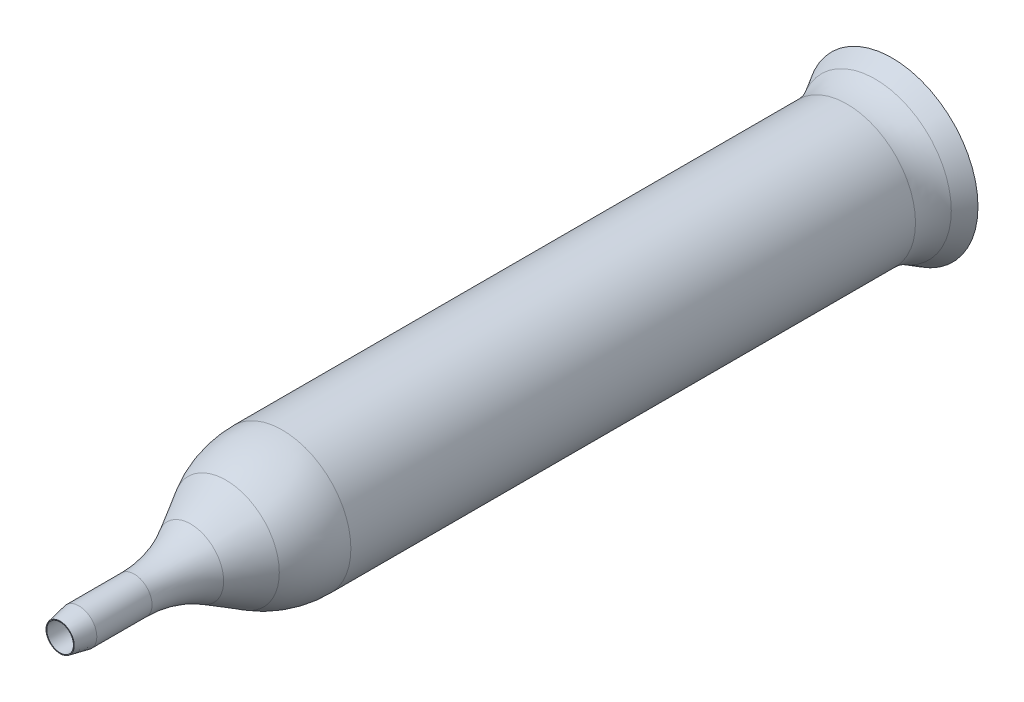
ISO-10303-21;
HEADER;
FILE_DESCRIPTION(('STEP AP214'),'2;1');
FILE_NAME('part.step','',(''),(''),'','','');
FILE_SCHEMA(('AUTOMOTIVE_DESIGN { 1 0 10303 214 1 1 1 1 }'));
ENDSEC;
DATA;
#1=APPLICATION_CONTEXT('core data for automotive mechanical design processes');
#2=APPLICATION_PROTOCOL_DEFINITION('international standard','automotive_design',2000,#1);
#3=PRODUCT_CONTEXT('',#1,'mechanical');
#4=PRODUCT('Part','Part','',(#3));
#5=PRODUCT_RELATED_PRODUCT_CATEGORY('part','',(#4));
#6=PRODUCT_DEFINITION_FORMATION('','',#4);
#7=PRODUCT_DEFINITION_CONTEXT('part definition',#1,'design');
#8=PRODUCT_DEFINITION('design','',#6,#7);
#9=PRODUCT_DEFINITION_SHAPE('','',#8);
#10=(LENGTH_UNIT() NAMED_UNIT(*) SI_UNIT(.MILLI.,.METRE.));
#11=(NAMED_UNIT(*) PLANE_ANGLE_UNIT() SI_UNIT($,.RADIAN.));
#12=(NAMED_UNIT(*) SI_UNIT($,.STERADIAN.) SOLID_ANGLE_UNIT());
#13=UNCERTAINTY_MEASURE_WITH_UNIT(LENGTH_MEASURE(1.E-05),#10,'distance_accuracy_value','');
#14=(GEOMETRIC_REPRESENTATION_CONTEXT(3) GLOBAL_UNCERTAINTY_ASSIGNED_CONTEXT((#13)) GLOBAL_UNIT_ASSIGNED_CONTEXT((#10,
#11,#12)) REPRESENTATION_CONTEXT('',''));
#15=CARTESIAN_POINT('',(0.,0.,0.));
#16=DIRECTION('',(0.,0.,1.));
#17=DIRECTION('',(1.,0.,0.));
#18=AXIS2_PLACEMENT_3D('',#15,#16,#17);
#19=CARTESIAN_POINT('',(0.,3.55,133.805898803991));
#20=DIRECTION('',(0.,0.,-1.));
#21=DIRECTION('',(-1.,0.,0.));
#22=AXIS2_PLACEMENT_3D('',#19,#20,#21);
#23=PLANE('',#22);
#24=CARTESIAN_POINT('',(0.,0.,133.805898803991));
#25=DIRECTION('',(0.,0.,-1.));
#26=DIRECTION('',(-1.,0.,0.));
#27=AXIS2_PLACEMENT_3D('',#24,#25,#26);
#28=CIRCLE('',#27,3.75000000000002);
#29=CARTESIAN_POINT('',(-3.75000000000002,0.,133.805898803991));
#30=VERTEX_POINT('',#29);
#31=EDGE_CURVE('E45',#30,#30,#28,.F.);
#32=ORIENTED_EDGE('',*,*,#31,.T.);
#33=EDGE_LOOP('',(#32));
#34=FACE_BOUND('',#33,.T.);
#35=CARTESIAN_POINT('',(0.,0.,133.805898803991));
#36=DIRECTION('',(0.,0.,1.));
#37=DIRECTION('',(1.,0.,0.));
#38=AXIS2_PLACEMENT_3D('',#35,#36,#37);
#39=CIRCLE('',#38,3.55);
#40=CARTESIAN_POINT('',(3.55,0.,133.805898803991));
#41=VERTEX_POINT('',#40);
#42=EDGE_CURVE('E94',#41,#41,#39,.T.);
#43=ORIENTED_EDGE('',*,*,#42,.F.);
#44=EDGE_LOOP('',(#43));
#45=FACE_BOUND('',#44,.T.);
#46=ADVANCED_FACE('F37',(#34,#45),#23,.F.);
#47=CARTESIAN_POINT('',(0.,0.,0.));
#48=DIRECTION('',(0.,0.,1.));
#49=DIRECTION('',(1.,0.,0.));
#50=AXIS2_PLACEMENT_3D('',#47,#48,#49);
#51=CYLINDRICAL_SURFACE('',#50,4.75);
#52=CARTESIAN_POINT('',(0.,0.,128.805898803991));
#53=DIRECTION('',(0.,0.,-1.));
#54=DIRECTION('',(-1.,0.,0.));
#55=AXIS2_PLACEMENT_3D('',#52,#53,#54);
#56=CIRCLE('',#55,4.75);
#57=CARTESIAN_POINT('',(-4.75,0.,128.805898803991));
#58=VERTEX_POINT('',#57);
#59=EDGE_CURVE('E10',#58,#58,#56,.T.);
#60=ORIENTED_EDGE('',*,*,#59,.T.);
#61=EDGE_LOOP('',(#60));
#62=FACE_BOUND('',#61,.T.);
#63=CARTESIAN_POINT('',(0.,0.,114.127437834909));
#64=DIRECTION('',(0.,0.,1.));
#65=DIRECTION('',(1.,0.,0.));
#66=AXIS2_PLACEMENT_3D('',#63,#64,#65);
#67=CIRCLE('',#66,4.75);
#68=CARTESIAN_POINT('',(4.75,0.,114.127437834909));
#69=VERTEX_POINT('',#68);
#70=EDGE_CURVE('E49',#69,#69,#67,.T.);
#71=ORIENTED_EDGE('',*,*,#70,.T.);
#72=EDGE_LOOP('',(#71));
#73=FACE_BOUND('',#72,.T.);
#74=ADVANCED_FACE('F101',(#62,#73),#51,.T.);
#75=CARTESIAN_POINT('',(0.,0.,114.127437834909));
#76=DIRECTION('',(0.,0.,1.));
#77=DIRECTION('',(1.,0.,0.));
#78=AXIS2_PLACEMENT_3D('',#75,#76,#77);
#79=TOROIDAL_SURFACE('',#78,34.75,30.);
#80=ORIENTED_EDGE('',*,*,#70,.F.);
#81=EDGE_LOOP('',(#80));
#82=FACE_BOUND('',#81,.T.);
#83=CARTESIAN_POINT('',(0.,0.,99.1274378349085));
#84=DIRECTION('',(0.,0.,1.));
#85=DIRECTION('',(1.,0.,0.));
#86=AXIS2_PLACEMENT_3D('',#83,#84,#85);
#87=CIRCLE('',#86,8.76923788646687);
#88=CARTESIAN_POINT('',(8.76923788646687,0.,99.1274378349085));
#89=VERTEX_POINT('',#88);
#90=EDGE_CURVE('E53',#89,#89,#87,.T.);
#91=ORIENTED_EDGE('',*,*,#90,.T.);
#92=EDGE_LOOP('',(#91));
#93=FACE_BOUND('',#92,.T.);
#94=ADVANCED_FACE('F105',(#82,#93),#79,.F.);
#95=CARTESIAN_POINT('',(0.,0.,89.75440292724));
#96=DIRECTION('',(0.,0.,-1.));
#97=DIRECTION('',(-1.,0.,0.));
#98=AXIS2_PLACEMENT_3D('',#95,#96,#97);
#99=CONICAL_SURFACE('',#98,14.1807621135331,0.523598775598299);
#100=ORIENTED_EDGE('',*,*,#90,.F.);
#101=EDGE_LOOP('',(#100));
#102=FACE_BOUND('',#101,.T.);
#103=CARTESIAN_POINT('',(0.,0.,89.75440292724));
#104=DIRECTION('',(0.,0.,1.));
#105=DIRECTION('',(1.,0.,0.));
#106=AXIS2_PLACEMENT_3D('',#103,#104,#105);
#107=CIRCLE('',#106,14.1807621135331);
#108=CARTESIAN_POINT('',(14.1807621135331,0.,89.75440292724));
#109=VERTEX_POINT('',#108);
#110=EDGE_CURVE('E58',#109,#109,#107,.T.);
#111=ORIENTED_EDGE('',*,*,#110,.T.);
#112=EDGE_LOOP('',(#111));
#113=FACE_BOUND('',#112,.T.);
#114=ADVANCED_FACE('F110',(#102,#113),#99,.T.);
#115=CARTESIAN_POINT('',(0.,0.,74.75440292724));
#116=DIRECTION('',(0.,0.,1.));
#117=DIRECTION('',(1.,0.,0.));
#118=AXIS2_PLACEMENT_3D('',#115,#116,#117);
#119=DEGENERATE_TOROIDAL_SURFACE('',#118,11.8000000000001,30.,.F.);
#120=ORIENTED_EDGE('',*,*,#110,.F.);
#121=EDGE_LOOP('',(#120));
#122=FACE_BOUND('',#121,.T.);
#123=CARTESIAN_POINT('',(0.,0.,74.75440292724));
#124=DIRECTION('',(0.,0.,1.));
#125=DIRECTION('',(1.,0.,0.));
#126=AXIS2_PLACEMENT_3D('',#123,#124,#125);
#127=CIRCLE('',#126,18.1999999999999);
#128=CARTESIAN_POINT('',(18.1999999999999,0.,74.75440292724));
#129=VERTEX_POINT('',#128);
#130=EDGE_CURVE('E61',#129,#129,#127,.T.);
#131=ORIENTED_EDGE('',*,*,#130,.T.);
#132=EDGE_LOOP('',(#131));
#133=FACE_BOUND('',#132,.T.);
#134=ADVANCED_FACE('F114',(#122,#133),#119,.F.);
#135=CARTESIAN_POINT('',(0.,0.,0.));
#136=DIRECTION('',(0.,0.,1.));
#137=DIRECTION('',(1.,0.,0.));
#138=AXIS2_PLACEMENT_3D('',#135,#136,#137);
#139=CYLINDRICAL_SURFACE('',#138,18.1999999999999);
#140=ORIENTED_EDGE('',*,*,#130,.F.);
#141=EDGE_LOOP('',(#140));
#142=FACE_BOUND('',#141,.T.);
#143=CARTESIAN_POINT('',(0.,0.,-75.24559707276));
#144=DIRECTION('',(0.,0.,1.));
#145=DIRECTION('',(1.,0.,0.));
#146=AXIS2_PLACEMENT_3D('',#143,#144,#145);
#147=CIRCLE('',#146,18.1999999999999);
#148=CARTESIAN_POINT('',(18.1999999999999,0.,-75.24559707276));
#149=VERTEX_POINT('',#148);
#150=EDGE_CURVE('E64',#149,#149,#147,.T.);
#151=ORIENTED_EDGE('',*,*,#150,.T.);
#152=EDGE_LOOP('',(#151));
#153=FACE_BOUND('',#152,.T.);
#154=ADVANCED_FACE('F118',(#142,#153),#139,.T.);
#155=CARTESIAN_POINT('',(0.,0.,-75.24559707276));
#156=DIRECTION('',(0.,0.,1.));
#157=DIRECTION('',(1.,0.,0.));
#158=AXIS2_PLACEMENT_3D('',#155,#156,#157);
#159=TOROIDAL_SURFACE('',#158,33.1999999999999,15.);
#160=ORIENTED_EDGE('',*,*,#150,.F.);
#161=EDGE_LOOP('',(#160));
#162=FACE_BOUND('',#161,.T.);
#163=CARTESIAN_POINT('',(0.,0.,-82.7455970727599));
#164=DIRECTION('',(0.,0.,1.));
#165=DIRECTION('',(1.,0.,0.));
#166=AXIS2_PLACEMENT_3D('',#163,#164,#165);
#167=CIRCLE('',#166,20.2096189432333);
#168=CARTESIAN_POINT('',(20.2096189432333,0.,-82.7455970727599));
#169=VERTEX_POINT('',#168);
#170=EDGE_CURVE('E67',#169,#169,#167,.T.);
#171=ORIENTED_EDGE('',*,*,#170,.T.);
#172=EDGE_LOOP('',(#171));
#173=FACE_BOUND('',#172,.T.);
#174=ADVANCED_FACE('F122',(#162,#173),#159,.F.);
#175=CARTESIAN_POINT('',(0.,0.,-87.24559707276));
#176=DIRECTION('',(0.,0.,-1.));
#177=DIRECTION('',(-1.,0.,0.));
#178=AXIS2_PLACEMENT_3D('',#175,#176,#177);
#179=CONICAL_SURFACE('',#178,22.8076951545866,0.523598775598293);
#180=ORIENTED_EDGE('',*,*,#170,.F.);
#181=EDGE_LOOP('',(#180));
#182=FACE_BOUND('',#181,.T.);
#183=CARTESIAN_POINT('',(0.,0.,-87.24559707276));
#184=DIRECTION('',(0.,0.,1.));
#185=DIRECTION('',(1.,0.,0.));
#186=AXIS2_PLACEMENT_3D('',#183,#184,#185);
#187=CIRCLE('',#186,22.8076951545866);
#188=CARTESIAN_POINT('',(22.8076951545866,0.,-87.24559707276));
#189=VERTEX_POINT('',#188);
#190=EDGE_CURVE('E70',#189,#189,#187,.T.);
#191=ORIENTED_EDGE('',*,*,#190,.T.);
#192=EDGE_LOOP('',(#191));
#193=FACE_BOUND('',#192,.T.);
#194=ADVANCED_FACE('F126',(#182,#193),#179,.T.);
#195=CARTESIAN_POINT('',(0.,0.,-87.5620290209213));
#196=DIRECTION('',(0.,0.,1.));
#197=DIRECTION('',(1.,0.,0.));
#198=AXIS2_PLACEMENT_3D('',#195,#196,#197);
#199=CONICAL_SURFACE('',#198,22.2596189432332,1.04719755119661);
#200=ORIENTED_EDGE('',*,*,#190,.F.);
#201=EDGE_LOOP('',(#200));
#202=FACE_BOUND('',#201,.T.);
#203=CARTESIAN_POINT('',(0.,0.,-87.5620290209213));
#204=DIRECTION('',(0.,0.,1.));
#205=DIRECTION('',(1.,0.,0.));
#206=AXIS2_PLACEMENT_3D('',#203,#204,#205);
#207=CIRCLE('',#206,22.2596189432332);
#208=CARTESIAN_POINT('',(22.2596189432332,0.,-87.5620290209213));
#209=VERTEX_POINT('',#208);
#210=EDGE_CURVE('E73',#209,#209,#207,.T.);
#211=ORIENTED_EDGE('',*,*,#210,.T.);
#212=EDGE_LOOP('',(#211));
#213=FACE_BOUND('',#212,.T.);
#214=ADVANCED_FACE('F130',(#202,#213),#199,.T.);
#215=CARTESIAN_POINT('',(0.,0.,-81.9328638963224));
#216=DIRECTION('',(0.,0.,-1.));
#217=DIRECTION('',(-1.,0.,0.));
#218=AXIS2_PLACEMENT_3D('',#215,#216,#217);
#219=CONICAL_SURFACE('',#218,19.0096189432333,0.523598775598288);
#220=ORIENTED_EDGE('',*,*,#210,.F.);
#221=EDGE_LOOP('',(#220));
#222=FACE_BOUND('',#221,.T.);
#223=CARTESIAN_POINT('',(0.,0.,-81.9328638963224));
#224=DIRECTION('',(0.,0.,1.));
#225=DIRECTION('',(1.,0.,0.));
#226=AXIS2_PLACEMENT_3D('',#223,#224,#225);
#227=CIRCLE('',#226,19.0096189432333);
#228=CARTESIAN_POINT('',(19.0096189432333,0.,-81.9328638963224));
#229=VERTEX_POINT('',#228);
#230=EDGE_CURVE('E76',#229,#229,#227,.T.);
#231=ORIENTED_EDGE('',*,*,#230,.T.);
#232=EDGE_LOOP('',(#231));
#233=FACE_BOUND('',#232,.T.);
#234=ADVANCED_FACE('F134',(#222,#233),#219,.F.);
#235=CARTESIAN_POINT('',(0.,0.,-74.4328638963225));
#236=DIRECTION('',(0.,0.,1.));
#237=DIRECTION('',(1.,0.,0.));
#238=AXIS2_PLACEMENT_3D('',#235,#236,#237);
#239=TOROIDAL_SURFACE('',#238,31.9999999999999,15.);
#240=ORIENTED_EDGE('',*,*,#230,.F.);
#241=EDGE_LOOP('',(#240));
#242=FACE_BOUND('',#241,.T.);
#243=CARTESIAN_POINT('',(0.,0.,-74.4328638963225));
#244=DIRECTION('',(0.,0.,1.));
#245=DIRECTION('',(1.,0.,0.));
#246=AXIS2_PLACEMENT_3D('',#243,#244,#245);
#247=CIRCLE('',#246,17.);
#248=CARTESIAN_POINT('',(17.,0.,-74.4328638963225));
#249=VERTEX_POINT('',#248);
#250=EDGE_CURVE('E79',#249,#249,#247,.T.);
#251=ORIENTED_EDGE('',*,*,#250,.T.);
#252=EDGE_LOOP('',(#251));
#253=FACE_BOUND('',#252,.T.);
#254=ADVANCED_FACE('F138',(#242,#253),#239,.T.);
#255=CARTESIAN_POINT('',(0.,0.,0.));
#256=DIRECTION('',(0.,0.,1.));
#257=DIRECTION('',(1.,0.,0.));
#258=AXIS2_PLACEMENT_3D('',#255,#256,#257);
#259=CYLINDRICAL_SURFACE('',#258,17.);
#260=ORIENTED_EDGE('',*,*,#250,.F.);
#261=EDGE_LOOP('',(#260));
#262=FACE_BOUND('',#261,.T.);
#263=CARTESIAN_POINT('',(0.,0.,74.4328638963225));
#264=DIRECTION('',(0.,0.,1.));
#265=DIRECTION('',(1.,0.,0.));
#266=AXIS2_PLACEMENT_3D('',#263,#264,#265);
#267=CIRCLE('',#266,17.);
#268=CARTESIAN_POINT('',(17.,0.,74.4328638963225));
#269=VERTEX_POINT('',#268);
#270=EDGE_CURVE('E82',#269,#269,#267,.T.);
#271=ORIENTED_EDGE('',*,*,#270,.T.);
#272=EDGE_LOOP('',(#271));
#273=FACE_BOUND('',#272,.T.);
#274=ADVANCED_FACE('F142',(#262,#273),#259,.F.);
#275=CARTESIAN_POINT('',(0.,0.,74.4328638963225));
#276=DIRECTION('',(0.,0.,1.));
#277=DIRECTION('',(1.,0.,0.));
#278=AXIS2_PLACEMENT_3D('',#275,#276,#277);
#279=DEGENERATE_TOROIDAL_SURFACE('',#278,13.,30.,.F.);
#280=ORIENTED_EDGE('',*,*,#270,.F.);
#281=EDGE_LOOP('',(#280));
#282=FACE_BOUND('',#281,.T.);
#283=CARTESIAN_POINT('',(0.,0.,89.4328638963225));
#284=DIRECTION('',(0.,0.,1.));
#285=DIRECTION('',(1.,0.,0.));
#286=AXIS2_PLACEMENT_3D('',#283,#284,#285);
#287=CIRCLE('',#286,12.9807621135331);
#288=CARTESIAN_POINT('',(12.9807621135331,0.,89.4328638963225));
#289=VERTEX_POINT('',#288);
#290=EDGE_CURVE('E85',#289,#289,#287,.T.);
#291=ORIENTED_EDGE('',*,*,#290,.T.);
#292=EDGE_LOOP('',(#291));
#293=FACE_BOUND('',#292,.T.);
#294=ADVANCED_FACE('F146',(#282,#293),#279,.T.);
#295=CARTESIAN_POINT('',(0.,0.,98.8058988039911));
#296=DIRECTION('',(0.,0.,-1.));
#297=DIRECTION('',(-1.,0.,0.));
#298=AXIS2_PLACEMENT_3D('',#295,#296,#297);
#299=CONICAL_SURFACE('',#298,7.56923788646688,0.523598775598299);
#300=ORIENTED_EDGE('',*,*,#290,.F.);
#301=EDGE_LOOP('',(#300));
#302=FACE_BOUND('',#301,.T.);
#303=CARTESIAN_POINT('',(0.,0.,98.8058988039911));
#304=DIRECTION('',(0.,0.,1.));
#305=DIRECTION('',(1.,0.,0.));
#306=AXIS2_PLACEMENT_3D('',#303,#304,#305);
#307=CIRCLE('',#306,7.56923788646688);
#308=CARTESIAN_POINT('',(7.56923788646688,0.,98.8058988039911));
#309=VERTEX_POINT('',#308);
#310=EDGE_CURVE('E88',#309,#309,#307,.T.);
#311=ORIENTED_EDGE('',*,*,#310,.T.);
#312=EDGE_LOOP('',(#311));
#313=FACE_BOUND('',#312,.T.);
#314=ADVANCED_FACE('F150',(#302,#313),#299,.F.);
#315=CARTESIAN_POINT('',(0.,0.,113.805898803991));
#316=DIRECTION('',(0.,0.,1.));
#317=DIRECTION('',(1.,0.,0.));
#318=AXIS2_PLACEMENT_3D('',#315,#316,#317);
#319=TOROIDAL_SURFACE('',#318,33.55,30.);
#320=ORIENTED_EDGE('',*,*,#310,.F.);
#321=EDGE_LOOP('',(#320));
#322=FACE_BOUND('',#321,.T.);
#323=CARTESIAN_POINT('',(0.,0.,113.805898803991));
#324=DIRECTION('',(0.,0.,1.));
#325=DIRECTION('',(1.,0.,0.));
#326=AXIS2_PLACEMENT_3D('',#323,#324,#325);
#327=CIRCLE('',#326,3.55);
#328=CARTESIAN_POINT('',(3.55,0.,113.805898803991));
#329=VERTEX_POINT('',#328);
#330=EDGE_CURVE('E91',#329,#329,#327,.T.);
#331=ORIENTED_EDGE('',*,*,#330,.T.);
#332=EDGE_LOOP('',(#331));
#333=FACE_BOUND('',#332,.T.);
#334=ADVANCED_FACE('F154',(#322,#333),#319,.T.);
#335=CARTESIAN_POINT('',(0.,0.,0.));
#336=DIRECTION('',(0.,0.,1.));
#337=DIRECTION('',(1.,0.,0.));
#338=AXIS2_PLACEMENT_3D('',#335,#336,#337);
#339=CYLINDRICAL_SURFACE('',#338,3.55);
#340=ORIENTED_EDGE('',*,*,#330,.F.);
#341=EDGE_LOOP('',(#340));
#342=FACE_BOUND('',#341,.T.);
#343=ORIENTED_EDGE('',*,*,#42,.T.);
#344=EDGE_LOOP('',(#343));
#345=FACE_BOUND('',#344,.T.);
#346=ADVANCED_FACE('F98',(#342,#345),#339,.F.);
#347=CARTESIAN_POINT('',(0.,0.,133.805898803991));
#348=DIRECTION('',(0.,0.,-1.));
#349=DIRECTION('',(-1.,0.,0.));
#350=AXIS2_PLACEMENT_3D('',#347,#348,#349);
#351=CONICAL_SURFACE('',#350,3.75000000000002,0.197395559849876);
#352=ORIENTED_EDGE('',*,*,#59,.F.);
#353=EDGE_LOOP('',(#352));
#354=FACE_BOUND('',#353,.T.);
#355=ORIENTED_EDGE('',*,*,#31,.F.);
#356=EDGE_LOOP('',(#355));
#357=FACE_BOUND('',#356,.T.);
#358=ADVANCED_FACE('F40',(#354,#357),#351,.T.);
#359=CLOSED_SHELL('',(#46,#74,#94,#114,#134,#154,#174,#194,#214,#234,#254,#274,#294,#314,#334,
#346,#358));
#360=MANIFOLD_SOLID_BREP('B2',#359);
#361=ADVANCED_BREP_SHAPE_REPRESENTATION('',(#18,#360),#14);
#362=SHAPE_DEFINITION_REPRESENTATION(#9,#361);
ENDSEC;
END-ISO-10303-21;
